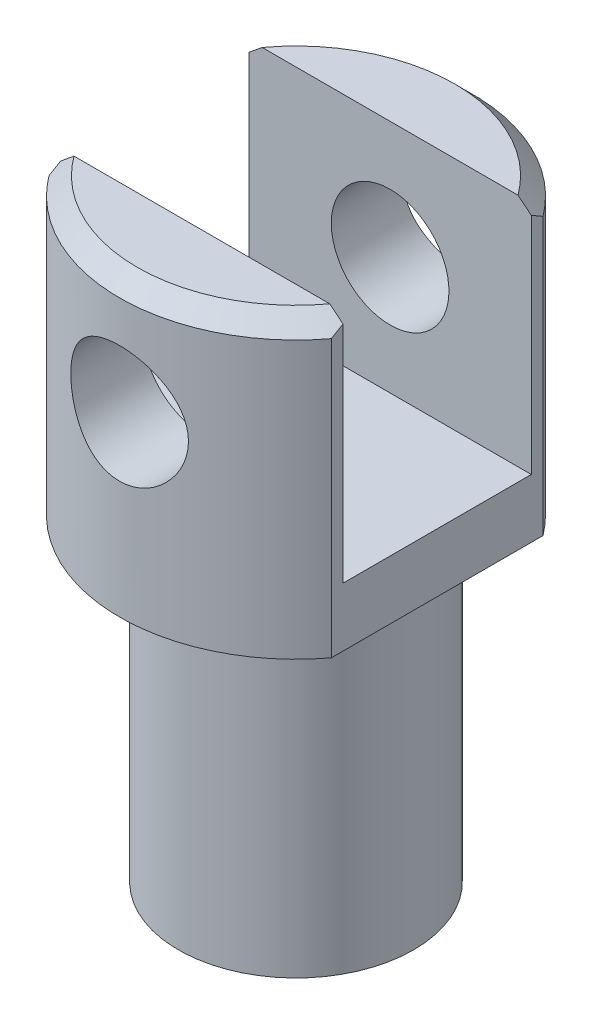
from build123d import *

# Parameters (mm, degrees)
ENL_V_START             = -20
ENL_V_MAT_EXTRU_1_DEPTH = 20
ESQUISSE4_W             = 24
ESQUISSE4_H             = 25
ENL_V_MAT_EXTRU_2_DEPTH = 3
ESQUISSE7_R             = 5
ENL_V_MAT_EXTRU_3_DEPTH = 42.472882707
PER_AGE1_D              = 8.5
PER_AGE1_DEPTH          = 27.5
PER_AGE1_TIP            = 2.553657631


with BuildPart() as part:
    # Esquisse1 → Base-R_volution (revolve)
    with BuildSketch(Plane.XY, mode=Mode.PRIVATE) as base_r_volution_sk:
        Polygon((0, 26), (13.5, 26), (15, 24.5), (15, 1), (10, 1), (10, -26), (0, -26), align=None)
    revolve(base_r_volution_sk.sketch.rotate(Axis((0, 40, 0), (0, -1, 0)), 270), axis=Axis((0, 40, 0), (0, -1, 0)))

    # Esquisse3 → Enl_v. mat.-Extru.1 (cut)
    with BuildSketch(Plane(origin=(0, 26, 0), x_dir=(-1, 0, 0), z_dir=(0, 1, 0)).offset(ENL_V_START)):
        with BuildLine():
            Line((12.68857754, -8), (-12.68857754, -8))
            ThreePointArc((-12.68857754, -8), (-15, 0), (-12.68857754, 8))
            Line((-12.68857754, 8), (12.68857754, 8))
            ThreePointArc((12.68857754, 8), (15, 0), (12.68857754, -8))
        make_face()
    extrude(amount=ENL_V_MAT_EXTRU_1_DEPTH, mode=Mode.SUBTRACT)

    # Esquisse4 → Enl_v. mat.-Extru.2 (cut)
    with BuildSketch(Plane(origin=(15, 12.75, 0), x_dir=(0, 0, -1), z_dir=(1, 0, 0))):
        with Locations((0, 0.75)):
            Rectangle(ESQUISSE4_W, ESQUISSE4_H)
    enl_v_mat_extru_2 = extrude(amount=-ENL_V_MAT_EXTRU_2_DEPTH, mode=Mode.SUBTRACT)

    # Sym_trie1: Enl_v. mat.-Extru.2 across plane
    add(enl_v_mat_extru_2.mirror(Plane(origin=(0, 0, 0), x_dir=(0, 0, 1), z_dir=(1, 0, 0))), mode=Mode.SUBTRACT)

    # Esquisse7 → Enl_v. mat.-Extru.3 (cut, through all)
    with BuildSketch(Plane.XY.offset(15)):
        with Locations(Location((0, 16, 0), (0, 0, 90))):
            Circle(ESQUISSE7_R)
    extrude(amount=-ENL_V_MAT_EXTRU_3_DEPTH, mode=Mode.SUBTRACT)

    # Per_age1
    with Locations(Plane.XZ.offset(26)):
        with Locations((0, 0)):
            Hole(PER_AGE1_D / 2, depth=PER_AGE1_DEPTH)
            with Locations((0, 0, -(PER_AGE1_DEPTH + PER_AGE1_TIP / 2))):  # 118° drill point
                Cone(0, PER_AGE1_D / 2, PER_AGE1_TIP, mode=Mode.SUBTRACT)


solid = part.part
